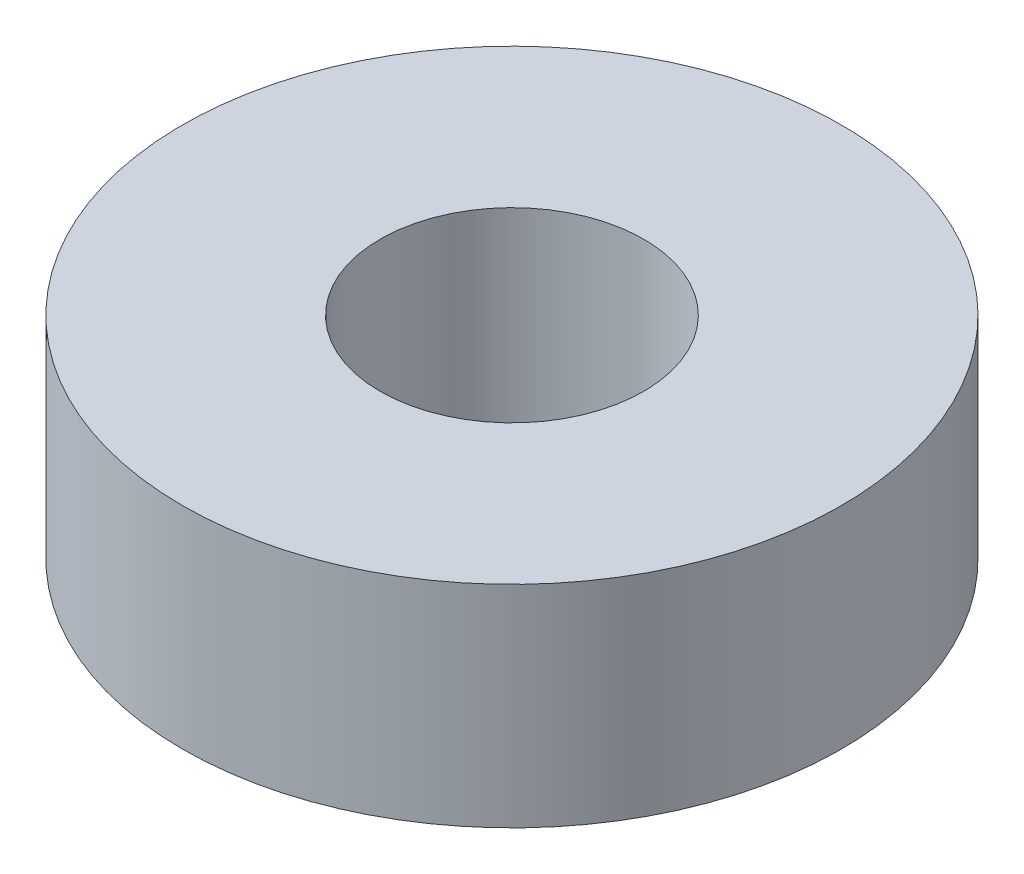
from build123d import *

# Parameters (mm, degrees)
SKETCH1_R      = 7.9375
SKETCH1_R_2    = 3.175
EXTRUDE1_DEPTH = 5.08


with BuildPart() as part:
    # Sketch1 → Extrude1 (new body)
    with BuildSketch(Plane(origin=(0, 0, 0), x_dir=(1, 0, 0), z_dir=(0, 1, 0))):
        with Locations(Location((0, 0, 0), (0, 0, 270))):
            Circle(SKETCH1_R)
        with Locations(Location((0, 0, 0), (0, 0, 270))):
            Circle(SKETCH1_R_2, mode=Mode.SUBTRACT)
    extrude(amount=EXTRUDE1_DEPTH)


solid = part.part
